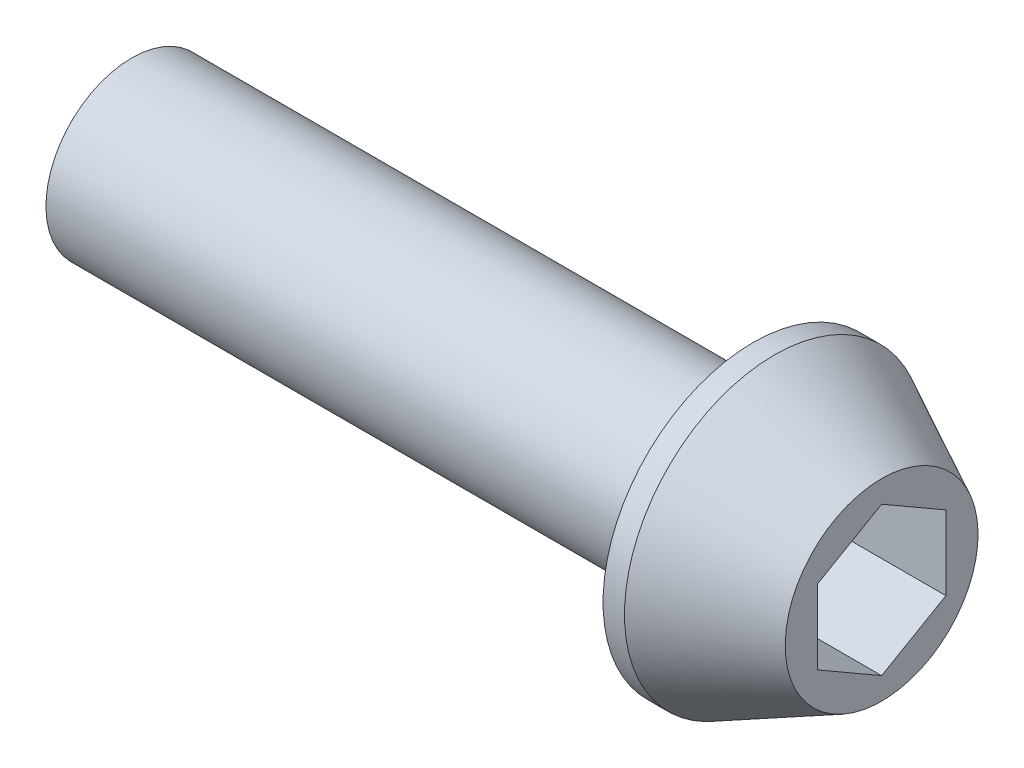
from build123d import *

# Parameters (mm, degrees)
CORTAR_EXTRUIR1_DEPTH = 5


with BuildPart() as part:
    # Croquis1 → Revoluci_n1 (revolve)
    with BuildSketch(Plane.XY):
        Polygon((0, 4.5), (0, 0), (-6, 0), (-6, 3), (-35, 3), (-35, 4), (-6, 4), (-6, 7), (-5, 7), align=None)
    revolve(axis=Axis((0, 0, 0), (-1, 0, 0)))

    # Croquis2 → Cortar-Extruir1 (cut)
    with BuildSketch(Plane(origin=(0, 0, 0), x_dir=(0, 0, -1), z_dir=(1, 0, 0))):
        Polygon((0, 3.464101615), (-3, 1.732050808), (-3, -1.732050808), (0, -3.464101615), (3, -1.732050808), (3, 1.732050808), align=None)
    extrude(amount=-CORTAR_EXTRUIR1_DEPTH, mode=Mode.SUBTRACT)


solid = part.part
